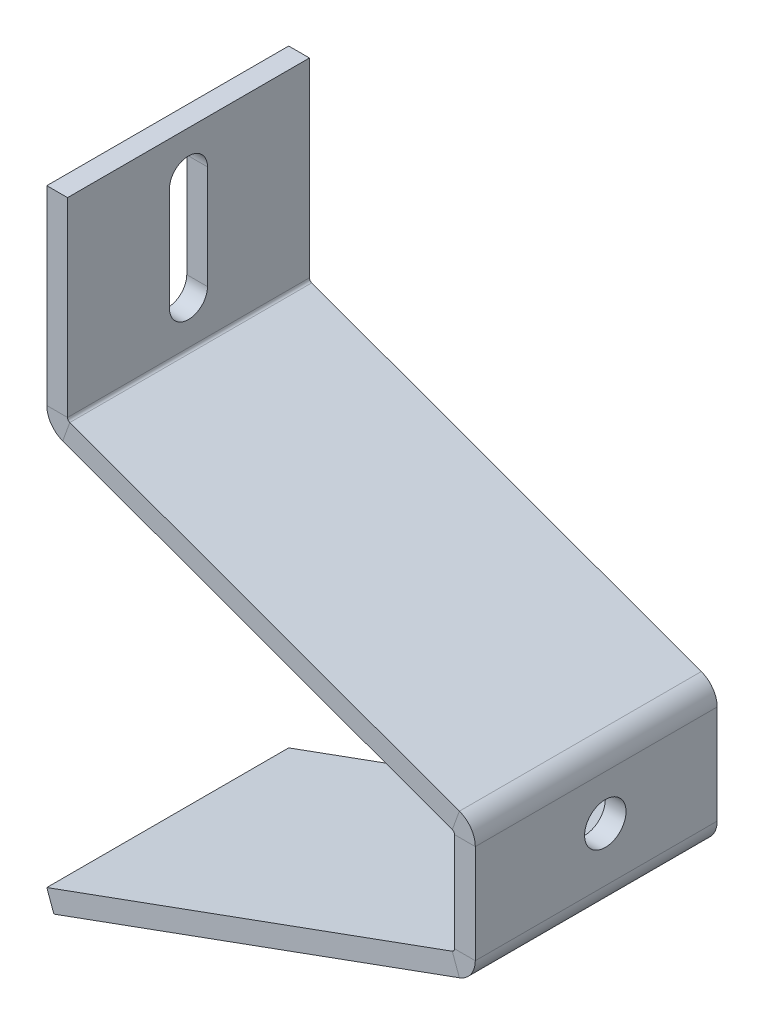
ISO-10303-21;
HEADER;
FILE_DESCRIPTION(('STEP AP214'),'2;1');
FILE_NAME('part.step','',(''),(''),'','','');
FILE_SCHEMA(('AUTOMOTIVE_DESIGN { 1 0 10303 214 1 1 1 1 }'));
ENDSEC;
DATA;
#1=APPLICATION_CONTEXT('core data for automotive mechanical design processes');
#2=APPLICATION_PROTOCOL_DEFINITION('international standard','automotive_design',2000,#1);
#3=PRODUCT_CONTEXT('',#1,'mechanical');
#4=PRODUCT('Part','Part','',(#3));
#5=PRODUCT_RELATED_PRODUCT_CATEGORY('part','',(#4));
#6=PRODUCT_DEFINITION_FORMATION('','',#4);
#7=PRODUCT_DEFINITION_CONTEXT('part definition',#1,'design');
#8=PRODUCT_DEFINITION('design','',#6,#7);
#9=PRODUCT_DEFINITION_SHAPE('','',#8);
#10=(LENGTH_UNIT() NAMED_UNIT(*) SI_UNIT(.MILLI.,.METRE.));
#11=(NAMED_UNIT(*) PLANE_ANGLE_UNIT() SI_UNIT($,.RADIAN.));
#12=(NAMED_UNIT(*) SI_UNIT($,.STERADIAN.) SOLID_ANGLE_UNIT());
#13=UNCERTAINTY_MEASURE_WITH_UNIT(LENGTH_MEASURE(1.E-05),#10,'distance_accuracy_value','');
#14=(GEOMETRIC_REPRESENTATION_CONTEXT(3) GLOBAL_UNCERTAINTY_ASSIGNED_CONTEXT((#13)) GLOBAL_UNIT_ASSIGNED_CONTEXT((#10,
#11,#12)) REPRESENTATION_CONTEXT('',''));
#15=CARTESIAN_POINT('',(0.,0.,0.));
#16=DIRECTION('',(0.,0.,1.));
#17=DIRECTION('',(1.,0.,0.));
#18=AXIS2_PLACEMENT_3D('',#15,#16,#17);
#19=CARTESIAN_POINT('',(118.,43.6486951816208,70.));
#20=DIRECTION('',(0.,0.,1.));
#21=DIRECTION('',(1.,0.,0.));
#22=AXIS2_PLACEMENT_3D('',#19,#20,#21);
#23=PLANE('',#22);
#24=DIRECTION('',(1.,0.,0.));
#25=VECTOR('',#24,1.);
#26=CARTESIAN_POINT('',(118.,43.6486951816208,70.));
#27=LINE('',#26,#25);
#28=CARTESIAN_POINT('',(118.,43.6486951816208,70.));
#29=VERTEX_POINT('',#28);
#30=CARTESIAN_POINT('',(124.,43.6486951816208,70.));
#31=VERTEX_POINT('',#30);
#32=EDGE_CURVE('E467',#29,#31,#27,.T.);
#33=ORIENTED_EDGE('',*,*,#32,.F.);
#34=CARTESIAN_POINT('',(117.,43.6486951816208,70.));
#35=DIRECTION('',(0.,0.,-1.));
#36=DIRECTION('',(-1.,0.,0.));
#37=AXIS2_PLACEMENT_3D('',#34,#35,#36);
#38=CIRCLE('',#37,1.);
#39=CARTESIAN_POINT('',(117.342020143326,42.7090025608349,70.));
#40=VERTEX_POINT('',#39);
#41=EDGE_CURVE('E290',#40,#29,#38,.F.);
#42=ORIENTED_EDGE('',*,*,#41,.F.);
#43=DIRECTION('',(-0.342020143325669,0.939692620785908,0.));
#44=VECTOR('',#43,1.);
#45=CARTESIAN_POINT('',(119.39414100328,37.0708468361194,70.));
#46=LINE('',#45,#44);
#47=CARTESIAN_POINT('',(119.39414100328,37.0708468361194,70.));
#48=VERTEX_POINT('',#47);
#49=EDGE_CURVE('E465',#48,#40,#46,.T.);
#50=ORIENTED_EDGE('',*,*,#49,.F.);
#51=CARTESIAN_POINT('',(117.,43.6486951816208,70.));
#52=DIRECTION('',(0.,0.,1.));
#53=DIRECTION('',(1.,0.,0.));
#54=AXIS2_PLACEMENT_3D('',#51,#52,#53);
#55=CIRCLE('',#54,7.);
#56=EDGE_CURVE('E305',#48,#31,#55,.T.);
#57=ORIENTED_EDGE('',*,*,#56,.T.);
#58=EDGE_LOOP('',(#33,#42,#50,#57));
#59=FACE_BOUND('',#58,.T.);
#60=ADVANCED_FACE('F46',(#59),#23,.T.);
#61=CARTESIAN_POINT('',(119.39414100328,37.0708468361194,70.));
#62=DIRECTION('',(0.,0.,1.));
#63=DIRECTION('',(1.,0.,0.));
#64=AXIS2_PLACEMENT_3D('',#61,#62,#63);
#65=PLANE('',#64);
#66=DIRECTION('',(0.,1.,0.));
#67=VECTOR('',#66,1.);
#68=CARTESIAN_POINT('',(118.,42.9484876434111,70.));
#69=LINE('',#68,#67);
#70=CARTESIAN_POINT('',(118.,72.2482801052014,70.));
#71=VERTEX_POINT('',#70);
#72=EDGE_CURVE('E286',#29,#71,#69,.T.);
#73=ORIENTED_EDGE('',*,*,#72,.F.);
#74=ORIENTED_EDGE('',*,*,#32,.T.);
#75=DIRECTION('',(0.,1.,0.));
#76=VECTOR('',#75,1.);
#77=CARTESIAN_POINT('',(124.,42.9484876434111,70.));
#78=LINE('',#77,#76);
#79=CARTESIAN_POINT('',(124.,72.2482801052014,70.));
#80=VERTEX_POINT('',#79);
#81=EDGE_CURVE('E309',#31,#80,#78,.T.);
#82=ORIENTED_EDGE('',*,*,#81,.T.);
#83=DIRECTION('',(-1.,0.,0.));
#84=VECTOR('',#83,1.);
#85=CARTESIAN_POINT('',(124.,72.2482801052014,70.));
#86=LINE('',#85,#84);
#87=EDGE_CURVE('E457',#80,#71,#86,.T.);
#88=ORIENTED_EDGE('',*,*,#87,.T.);
#89=EDGE_LOOP('',(#73,#74,#82,#88));
#90=FACE_BOUND('',#89,.T.);
#91=ADVANCED_FACE('F496',(#90),#65,.T.);
#92=CARTESIAN_POINT('',(117.342020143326,42.7090025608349,0.));
#93=DIRECTION('',(0.,0.,-1.));
#94=DIRECTION('',(-1.,0.,0.));
#95=AXIS2_PLACEMENT_3D('',#92,#93,#94);
#96=PLANE('',#95);
#97=DIRECTION('',(0.342020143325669,-0.939692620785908,0.));
#98=VECTOR('',#97,1.);
#99=CARTESIAN_POINT('',(117.342020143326,42.7090025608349,0.));
#100=LINE('',#99,#98);
#101=CARTESIAN_POINT('',(117.342020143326,42.7090025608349,0.));
#102=VERTEX_POINT('',#101);
#103=CARTESIAN_POINT('',(119.39414100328,37.0708468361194,0.));
#104=VERTEX_POINT('',#103);
#105=EDGE_CURVE('E463',#102,#104,#100,.T.);
#106=ORIENTED_EDGE('',*,*,#105,.F.);
#107=CARTESIAN_POINT('',(117.,43.6486951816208,0.));
#108=DIRECTION('',(0.,0.,-1.));
#109=DIRECTION('',(-1.,0.,0.));
#110=AXIS2_PLACEMENT_3D('',#107,#108,#109);
#111=CIRCLE('',#110,1.);
#112=CARTESIAN_POINT('',(118.,43.6486951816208,0.));
#113=VERTEX_POINT('',#112);
#114=EDGE_CURVE('E352',#102,#113,#111,.F.);
#115=ORIENTED_EDGE('',*,*,#114,.T.);
#116=DIRECTION('',(-1.,0.,0.));
#117=VECTOR('',#116,1.);
#118=CARTESIAN_POINT('',(124.,43.6486951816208,0.));
#119=LINE('',#118,#117);
#120=CARTESIAN_POINT('',(124.,43.6486951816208,0.));
#121=VERTEX_POINT('',#120);
#122=EDGE_CURVE('E461',#121,#113,#119,.T.);
#123=ORIENTED_EDGE('',*,*,#122,.F.);
#124=CARTESIAN_POINT('',(117.,43.6486951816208,0.));
#125=DIRECTION('',(0.,0.,1.));
#126=DIRECTION('',(1.,0.,0.));
#127=AXIS2_PLACEMENT_3D('',#124,#125,#126);
#128=CIRCLE('',#127,7.);
#129=EDGE_CURVE('E367',#104,#121,#128,.T.);
#130=ORIENTED_EDGE('',*,*,#129,.F.);
#131=EDGE_LOOP('',(#106,#115,#123,#130));
#132=FACE_BOUND('',#131,.T.);
#133=ADVANCED_FACE('F502',(#132),#96,.T.);
#134=CARTESIAN_POINT('',(124.,43.6486951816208,0.));
#135=DIRECTION('',(0.,0.,-1.));
#136=DIRECTION('',(-1.,0.,0.));
#137=AXIS2_PLACEMENT_3D('',#134,#135,#136);
#138=PLANE('',#137);
#139=DIRECTION('',(0.93969262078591,0.342020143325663,0.));
#140=VECTOR('',#139,1.);
#141=CARTESIAN_POINT('',(0.,0.,0.));
#142=LINE('',#141,#140);
#143=CARTESIAN_POINT('',(0.,0.,0.));
#144=VERTEX_POINT('',#143);
#145=EDGE_CURVE('E356',#144,#102,#142,.T.);
#146=ORIENTED_EDGE('',*,*,#145,.T.);
#147=ORIENTED_EDGE('',*,*,#105,.T.);
#148=DIRECTION('',(0.939692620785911,0.342020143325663,0.));
#149=VECTOR('',#148,1.);
#150=CARTESIAN_POINT('',(2.05212085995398,-5.63815572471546,0.));
#151=LINE('',#150,#149);
#152=CARTESIAN_POINT('',(2.05212085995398,-5.63815572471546,0.));
#153=VERTEX_POINT('',#152);
#154=EDGE_CURVE('E363',#153,#104,#151,.T.);
#155=ORIENTED_EDGE('',*,*,#154,.F.);
#156=DIRECTION('',(-0.342020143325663,0.93969262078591,0.));
#157=VECTOR('',#156,1.);
#158=CARTESIAN_POINT('',(2.05212085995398,-5.63815572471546,0.));
#159=LINE('',#158,#157);
#160=EDGE_CURVE('E360',#153,#144,#159,.T.);
#161=ORIENTED_EDGE('',*,*,#160,.T.);
#162=EDGE_LOOP('',(#146,#147,#155,#161));
#163=FACE_BOUND('',#162,.T.);
#164=ADVANCED_FACE('F559',(#163),#138,.T.);
#165=CARTESIAN_POINT('',(117.342020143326,73.1879727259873,70.));
#166=DIRECTION('',(0.,0.,1.));
#167=DIRECTION('',(1.,0.,0.));
#168=AXIS2_PLACEMENT_3D('',#165,#166,#167);
#169=PLANE('',#168);
#170=DIRECTION('',(0.342020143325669,0.939692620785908,0.));
#171=VECTOR('',#170,1.);
#172=CARTESIAN_POINT('',(117.342020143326,73.1879727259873,70.));
#173=LINE('',#172,#171);
#174=CARTESIAN_POINT('',(117.342020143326,73.1879727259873,70.));
#175=VERTEX_POINT('',#174);
#176=CARTESIAN_POINT('',(119.39414100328,78.8261284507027,70.));
#177=VERTEX_POINT('',#176);
#178=EDGE_CURVE('E459',#175,#177,#173,.T.);
#179=ORIENTED_EDGE('',*,*,#178,.F.);
#180=CARTESIAN_POINT('',(117.,72.2482801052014,70.));
#181=DIRECTION('',(0.,0.,-1.));
#182=DIRECTION('',(-1.,0.,0.));
#183=AXIS2_PLACEMENT_3D('',#180,#181,#182);
#184=CIRCLE('',#183,1.);
#185=EDGE_CURVE('E282',#71,#175,#184,.F.);
#186=ORIENTED_EDGE('',*,*,#185,.F.);
#187=ORIENTED_EDGE('',*,*,#87,.F.);
#188=CARTESIAN_POINT('',(117.,72.2482801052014,70.));
#189=DIRECTION('',(0.,0.,1.));
#190=DIRECTION('',(1.,0.,0.));
#191=AXIS2_PLACEMENT_3D('',#188,#189,#190);
#192=CIRCLE('',#191,7.);
#193=EDGE_CURVE('E313',#80,#177,#192,.T.);
#194=ORIENTED_EDGE('',*,*,#193,.T.);
#195=EDGE_LOOP('',(#179,#186,#187,#194));
#196=FACE_BOUND('',#195,.T.);
#197=ADVANCED_FACE('F547',(#196),#169,.T.);
#198=CARTESIAN_POINT('',(124.,72.2482801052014,70.));
#199=DIRECTION('',(0.,0.,1.));
#200=DIRECTION('',(1.,0.,0.));
#201=AXIS2_PLACEMENT_3D('',#198,#199,#200);
#202=PLANE('',#201);
#203=DIRECTION('',(-0.939692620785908,0.342020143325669,0.));
#204=VECTOR('',#203,1.);
#205=CARTESIAN_POINT('',(118.,72.9484876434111,70.));
#206=LINE('',#205,#204);
#207=CARTESIAN_POINT('',(4.60585899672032,114.22057970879,70.));
#208=VERTEX_POINT('',#207);
#209=EDGE_CURVE('E278',#175,#208,#206,.T.);
#210=ORIENTED_EDGE('',*,*,#209,.F.);
#211=ORIENTED_EDGE('',*,*,#178,.T.);
#212=DIRECTION('',(-0.939692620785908,0.342020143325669,0.));
#213=VECTOR('',#212,1.);
#214=CARTESIAN_POINT('',(120.052120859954,78.5866433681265,70.));
#215=LINE('',#214,#213);
#216=CARTESIAN_POINT('',(6.65797985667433,119.858735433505,70.));
#217=VERTEX_POINT('',#216);
#218=EDGE_CURVE('E317',#177,#217,#215,.T.);
#219=ORIENTED_EDGE('',*,*,#218,.T.);
#220=DIRECTION('',(-0.34202014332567,-0.939692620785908,0.));
#221=VECTOR('',#220,1.);
#222=CARTESIAN_POINT('',(6.65797985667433,119.858735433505,70.));
#223=LINE('',#222,#221);
#224=EDGE_CURVE('E449',#217,#208,#223,.T.);
#225=ORIENTED_EDGE('',*,*,#224,.T.);
#226=EDGE_LOOP('',(#210,#211,#219,#225));
#227=FACE_BOUND('',#226,.T.);
#228=ADVANCED_FACE('F565',(#227),#202,.T.);
#229=CARTESIAN_POINT('',(118.,72.2482801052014,0.));
#230=DIRECTION('',(0.,0.,-1.));
#231=DIRECTION('',(-1.,0.,0.));
#232=AXIS2_PLACEMENT_3D('',#229,#230,#231);
#233=PLANE('',#232);
#234=DIRECTION('',(1.,0.,0.));
#235=VECTOR('',#234,1.);
#236=CARTESIAN_POINT('',(118.,72.2482801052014,0.));
#237=LINE('',#236,#235);
#238=CARTESIAN_POINT('',(118.,72.2482801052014,0.));
#239=VERTEX_POINT('',#238);
#240=CARTESIAN_POINT('',(124.,72.2482801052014,0.));
#241=VERTEX_POINT('',#240);
#242=EDGE_CURVE('E455',#239,#241,#237,.T.);
#243=ORIENTED_EDGE('',*,*,#242,.F.);
#244=CARTESIAN_POINT('',(117.,72.2482801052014,0.));
#245=DIRECTION('',(0.,0.,-1.));
#246=DIRECTION('',(-1.,0.,0.));
#247=AXIS2_PLACEMENT_3D('',#244,#245,#246);
#248=CIRCLE('',#247,1.);
#249=CARTESIAN_POINT('',(117.342020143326,73.1879727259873,0.));
#250=VERTEX_POINT('',#249);
#251=EDGE_CURVE('E344',#239,#250,#248,.F.);
#252=ORIENTED_EDGE('',*,*,#251,.T.);
#253=DIRECTION('',(-0.342020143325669,-0.939692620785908,0.));
#254=VECTOR('',#253,1.);
#255=CARTESIAN_POINT('',(119.39414100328,78.8261284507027,0.));
#256=LINE('',#255,#254);
#257=CARTESIAN_POINT('',(119.39414100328,78.8261284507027,0.));
#258=VERTEX_POINT('',#257);
#259=EDGE_CURVE('E453',#258,#250,#256,.T.);
#260=ORIENTED_EDGE('',*,*,#259,.F.);
#261=CARTESIAN_POINT('',(117.,72.2482801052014,0.));
#262=DIRECTION('',(0.,0.,1.));
#263=DIRECTION('',(1.,0.,0.));
#264=AXIS2_PLACEMENT_3D('',#261,#262,#263);
#265=CIRCLE('',#264,7.);
#266=EDGE_CURVE('E375',#241,#258,#265,.T.);
#267=ORIENTED_EDGE('',*,*,#266,.F.);
#268=EDGE_LOOP('',(#243,#252,#260,#267));
#269=FACE_BOUND('',#268,.T.);
#270=ADVANCED_FACE('F571',(#269),#233,.T.);
#271=CARTESIAN_POINT('',(119.39414100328,78.8261284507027,0.));
#272=DIRECTION('',(0.,0.,-1.));
#273=DIRECTION('',(-1.,0.,0.));
#274=AXIS2_PLACEMENT_3D('',#271,#272,#273);
#275=PLANE('',#274);
#276=DIRECTION('',(0.,1.,0.));
#277=VECTOR('',#276,1.);
#278=CARTESIAN_POINT('',(118.,42.9484876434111,0.));
#279=LINE('',#278,#277);
#280=EDGE_CURVE('E348',#113,#239,#279,.T.);
#281=ORIENTED_EDGE('',*,*,#280,.T.);
#282=ORIENTED_EDGE('',*,*,#242,.T.);
#283=DIRECTION('',(0.,1.,0.));
#284=VECTOR('',#283,1.);
#285=CARTESIAN_POINT('',(124.,42.9484876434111,0.));
#286=LINE('',#285,#284);
#287=EDGE_CURVE('E371',#121,#241,#286,.T.);
#288=ORIENTED_EDGE('',*,*,#287,.F.);
#289=ORIENTED_EDGE('',*,*,#122,.T.);
#290=EDGE_LOOP('',(#281,#282,#288,#289));
#291=FACE_BOUND('',#290,.T.);
#292=ADVANCED_FACE('F556',(#291),#275,.T.);
#293=CARTESIAN_POINT('',(0.,120.798428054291,70.));
#294=DIRECTION('',(0.,0.,1.));
#295=DIRECTION('',(1.,0.,0.));
#296=AXIS2_PLACEMENT_3D('',#293,#294,#295);
#297=PLANE('',#296);
#298=DIRECTION('',(1.,0.,0.));
#299=VECTOR('',#298,1.);
#300=CARTESIAN_POINT('',(0.,120.798428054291,70.));
#301=LINE('',#300,#299);
#302=CARTESIAN_POINT('',(0.,120.798428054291,70.));
#303=VERTEX_POINT('',#302);
#304=CARTESIAN_POINT('',(6.,120.798428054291,70.));
#305=VERTEX_POINT('',#304);
#306=EDGE_CURVE('E451',#303,#305,#301,.T.);
#307=ORIENTED_EDGE('',*,*,#306,.F.);
#308=CARTESIAN_POINT('',(7.,120.798428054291,70.));
#309=DIRECTION('',(0.,0.,1.));
#310=DIRECTION('',(1.,0.,0.));
#311=AXIS2_PLACEMENT_3D('',#308,#309,#310);
#312=CIRCLE('',#311,7.);
#313=EDGE_CURVE('E274',#208,#303,#312,.F.);
#314=ORIENTED_EDGE('',*,*,#313,.F.);
#315=ORIENTED_EDGE('',*,*,#224,.F.);
#316=CARTESIAN_POINT('',(7.,120.798428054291,70.));
#317=DIRECTION('',(0.,0.,1.));
#318=DIRECTION('',(1.,0.,0.));
#319=AXIS2_PLACEMENT_3D('',#316,#317,#318);
#320=CIRCLE('',#319,1.);
#321=EDGE_CURVE('E321',#217,#305,#320,.F.);
#322=ORIENTED_EDGE('',*,*,#321,.T.);
#323=EDGE_LOOP('',(#307,#314,#315,#322));
#324=FACE_BOUND('',#323,.T.);
#325=ADVANCED_FACE('F576',(#324),#297,.T.);
#326=CARTESIAN_POINT('',(6.65797985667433,119.858735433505,70.));
#327=DIRECTION('',(0.,0.,1.));
#328=DIRECTION('',(1.,0.,0.));
#329=AXIS2_PLACEMENT_3D('',#326,#327,#328);
#330=PLANE('',#329);
#331=DIRECTION('',(0.,1.,0.));
#332=VECTOR('',#331,1.);
#333=CARTESIAN_POINT('',(0.,115.896975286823,70.));
#334=LINE('',#333,#332);
#335=CARTESIAN_POINT('',(0.,175.896975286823,70.));
#336=VERTEX_POINT('',#335);
#337=EDGE_CURVE('E271',#303,#336,#334,.T.);
#338=ORIENTED_EDGE('',*,*,#337,.F.);
#339=ORIENTED_EDGE('',*,*,#306,.T.);
#340=DIRECTION('',(0.,1.,0.));
#341=VECTOR('',#340,1.);
#342=CARTESIAN_POINT('',(6.,115.896975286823,70.));
#343=LINE('',#342,#341);
#344=CARTESIAN_POINT('',(6.,175.896975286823,70.));
#345=VERTEX_POINT('',#344);
#346=EDGE_CURVE('E264',#305,#345,#343,.T.);
#347=ORIENTED_EDGE('',*,*,#346,.T.);
#348=DIRECTION('',(1.,0.,0.));
#349=VECTOR('',#348,1.);
#350=CARTESIAN_POINT('',(0.,175.896975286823,70.));
#351=LINE('',#350,#349);
#352=EDGE_CURVE('E267',#336,#345,#351,.T.);
#353=ORIENTED_EDGE('',*,*,#352,.F.);
#354=EDGE_LOOP('',(#338,#339,#347,#353));
#355=FACE_BOUND('',#354,.T.);
#356=ADVANCED_FACE('F579',(#355),#330,.T.);
#357=CARTESIAN_POINT('',(4.60585899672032,114.22057970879,0.));
#358=DIRECTION('',(0.,0.,-1.));
#359=DIRECTION('',(-1.,0.,0.));
#360=AXIS2_PLACEMENT_3D('',#357,#358,#359);
#361=PLANE('',#360);
#362=DIRECTION('',(0.34202014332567,0.939692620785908,0.));
#363=VECTOR('',#362,1.);
#364=CARTESIAN_POINT('',(4.60585899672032,114.22057970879,0.));
#365=LINE('',#364,#363);
#366=CARTESIAN_POINT('',(4.60585899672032,114.22057970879,0.));
#367=VERTEX_POINT('',#366);
#368=CARTESIAN_POINT('',(6.65797985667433,119.858735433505,0.));
#369=VERTEX_POINT('',#368);
#370=EDGE_CURVE('E447',#367,#369,#365,.T.);
#371=ORIENTED_EDGE('',*,*,#370,.F.);
#372=CARTESIAN_POINT('',(7.,120.798428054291,0.));
#373=DIRECTION('',(0.,0.,1.));
#374=DIRECTION('',(1.,0.,0.));
#375=AXIS2_PLACEMENT_3D('',#372,#373,#374);
#376=CIRCLE('',#375,7.);
#377=CARTESIAN_POINT('',(0.,120.798428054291,0.));
#378=VERTEX_POINT('',#377);
#379=EDGE_CURVE('E336',#367,#378,#376,.F.);
#380=ORIENTED_EDGE('',*,*,#379,.T.);
#381=DIRECTION('',(-1.,0.,0.));
#382=VECTOR('',#381,1.);
#383=CARTESIAN_POINT('',(6.,120.798428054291,0.));
#384=LINE('',#383,#382);
#385=CARTESIAN_POINT('',(6.,120.798428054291,0.));
#386=VERTEX_POINT('',#385);
#387=EDGE_CURVE('E445',#386,#378,#384,.T.);
#388=ORIENTED_EDGE('',*,*,#387,.F.);
#389=CARTESIAN_POINT('',(7.,120.798428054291,0.));
#390=DIRECTION('',(0.,0.,1.));
#391=DIRECTION('',(1.,0.,0.));
#392=AXIS2_PLACEMENT_3D('',#389,#390,#391);
#393=CIRCLE('',#392,1.);
#394=EDGE_CURVE('E268',#369,#386,#393,.F.);
#395=ORIENTED_EDGE('',*,*,#394,.F.);
#396=EDGE_LOOP('',(#371,#380,#388,#395));
#397=FACE_BOUND('',#396,.T.);
#398=ADVANCED_FACE('F583',(#397),#361,.T.);
#399=CARTESIAN_POINT('',(6.,120.798428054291,0.));
#400=DIRECTION('',(0.,0.,-1.));
#401=DIRECTION('',(-1.,0.,0.));
#402=AXIS2_PLACEMENT_3D('',#399,#400,#401);
#403=PLANE('',#402);
#404=DIRECTION('',(-0.939692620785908,0.342020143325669,0.));
#405=VECTOR('',#404,1.);
#406=CARTESIAN_POINT('',(118.,72.9484876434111,0.));
#407=LINE('',#406,#405);
#408=EDGE_CURVE('E340',#250,#367,#407,.T.);
#409=ORIENTED_EDGE('',*,*,#408,.T.);
#410=ORIENTED_EDGE('',*,*,#370,.T.);
#411=DIRECTION('',(-0.939692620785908,0.342020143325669,0.));
#412=VECTOR('',#411,1.);
#413=CARTESIAN_POINT('',(120.052120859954,78.5866433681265,0.));
#414=LINE('',#413,#412);
#415=EDGE_CURVE('E379',#258,#369,#414,.T.);
#416=ORIENTED_EDGE('',*,*,#415,.F.);
#417=ORIENTED_EDGE('',*,*,#259,.T.);
#418=EDGE_LOOP('',(#409,#410,#416,#417));
#419=FACE_BOUND('',#418,.T.);
#420=ADVANCED_FACE('F587',(#419),#403,.T.);
#421=CARTESIAN_POINT('',(6.,115.896975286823,70.));
#422=DIRECTION('',(-1.,0.,0.));
#423=DIRECTION('',(0.,-1.,0.));
#424=AXIS2_PLACEMENT_3D('',#421,#422,#423);
#425=PLANE('',#424);
#426=DIRECTION('',(0.,1.,0.));
#427=VECTOR('',#426,1.);
#428=CARTESIAN_POINT('',(6.,133.347701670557,29.5));
#429=LINE('',#428,#427);
#430=CARTESIAN_POINT('',(6.,133.347701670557,29.5));
#431=VERTEX_POINT('',#430);
#432=CARTESIAN_POINT('',(6.,163.347701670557,29.5));
#433=VERTEX_POINT('',#432);
#434=EDGE_CURVE('E234',#431,#433,#429,.T.);
#435=ORIENTED_EDGE('',*,*,#434,.F.);
#436=CARTESIAN_POINT('',(6.,133.347701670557,35.));
#437=DIRECTION('',(1.,0.,0.));
#438=DIRECTION('',(0.,1.,0.));
#439=AXIS2_PLACEMENT_3D('',#436,#437,#438);
#440=CIRCLE('',#439,5.5);
#441=CARTESIAN_POINT('',(6.,133.347701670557,40.5));
#442=VERTEX_POINT('',#441);
#443=EDGE_CURVE('E63',#442,#431,#440,.T.);
#444=ORIENTED_EDGE('',*,*,#443,.F.);
#445=DIRECTION('',(0.,-1.,0.));
#446=VECTOR('',#445,1.);
#447=CARTESIAN_POINT('',(6.,133.347701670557,40.5));
#448=LINE('',#447,#446);
#449=CARTESIAN_POINT('',(6.,163.347701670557,40.5));
#450=VERTEX_POINT('',#449);
#451=EDGE_CURVE('E242',#450,#442,#448,.T.);
#452=ORIENTED_EDGE('',*,*,#451,.F.);
#453=CARTESIAN_POINT('',(6.,163.347701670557,35.));
#454=DIRECTION('',(1.,0.,0.));
#455=DIRECTION('',(0.,1.,0.));
#456=AXIS2_PLACEMENT_3D('',#453,#454,#455);
#457=CIRCLE('',#456,5.50000000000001);
#458=EDGE_CURVE('E225',#433,#450,#457,.T.);
#459=ORIENTED_EDGE('',*,*,#458,.F.);
#460=EDGE_LOOP('',(#435,#444,#452,#459));
#461=FACE_BOUND('',#460,.T.);
#462=DIRECTION('',(0.,1.,0.));
#463=VECTOR('',#462,1.);
#464=CARTESIAN_POINT('',(6.,115.896975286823,0.));
#465=LINE('',#464,#463);
#466=CARTESIAN_POINT('',(6.,175.896975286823,0.));
#467=VERTEX_POINT('',#466);
#468=EDGE_CURVE('E263',#386,#467,#465,.T.);
#469=ORIENTED_EDGE('',*,*,#468,.T.);
#470=DIRECTION('',(0.,0.,-1.));
#471=VECTOR('',#470,1.);
#472=CARTESIAN_POINT('',(6.,175.896975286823,70.));
#473=LINE('',#472,#471);
#474=EDGE_CURVE('E442',#345,#467,#473,.T.);
#475=ORIENTED_EDGE('',*,*,#474,.F.);
#476=ORIENTED_EDGE('',*,*,#346,.F.);
#477=DIRECTION('',(0.,0.,-1.));
#478=VECTOR('',#477,1.);
#479=CARTESIAN_POINT('',(6.,120.798428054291,70.));
#480=LINE('',#479,#478);
#481=EDGE_CURVE('E325',#305,#386,#480,.T.);
#482=ORIENTED_EDGE('',*,*,#481,.T.);
#483=EDGE_LOOP('',(#469,#475,#476,#482));
#484=FACE_BOUND('',#483,.T.);
#485=ADVANCED_FACE('F239',(#461,#484),#425,.F.);
#486=CARTESIAN_POINT('',(0.,175.896975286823,70.));
#487=DIRECTION('',(0.,1.,0.));
#488=DIRECTION('',(0.,0.,1.));
#489=AXIS2_PLACEMENT_3D('',#486,#487,#488);
#490=PLANE('',#489);
#491=DIRECTION('',(1.,0.,0.));
#492=VECTOR('',#491,1.);
#493=CARTESIAN_POINT('',(0.,175.896975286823,0.));
#494=LINE('',#493,#492);
#495=CARTESIAN_POINT('',(0.,175.896975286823,0.));
#496=VERTEX_POINT('',#495);
#497=EDGE_CURVE('E329',#496,#467,#494,.T.);
#498=ORIENTED_EDGE('',*,*,#497,.F.);
#499=DIRECTION('',(0.,0.,-1.));
#500=VECTOR('',#499,1.);
#501=CARTESIAN_POINT('',(0.,175.896975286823,70.));
#502=LINE('',#501,#500);
#503=EDGE_CURVE('E439',#336,#496,#502,.T.);
#504=ORIENTED_EDGE('',*,*,#503,.F.);
#505=ORIENTED_EDGE('',*,*,#352,.T.);
#506=ORIENTED_EDGE('',*,*,#474,.T.);
#507=EDGE_LOOP('',(#498,#504,#505,#506));
#508=FACE_BOUND('',#507,.T.);
#509=ADVANCED_FACE('F594',(#508),#490,.T.);
#510=CARTESIAN_POINT('',(0.,115.896975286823,70.));
#511=DIRECTION('',(-1.,0.,0.));
#512=DIRECTION('',(0.,-1.,0.));
#513=AXIS2_PLACEMENT_3D('',#510,#511,#512);
#514=PLANE('',#513);
#515=CARTESIAN_POINT('',(0.,133.347701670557,35.));
#516=DIRECTION('',(-1.,0.,0.));
#517=DIRECTION('',(0.,-1.,0.));
#518=AXIS2_PLACEMENT_3D('',#515,#516,#517);
#519=CIRCLE('',#518,5.5);
#520=CARTESIAN_POINT('',(0.,133.347701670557,29.5));
#521=VERTEX_POINT('',#520);
#522=CARTESIAN_POINT('',(0.,133.347701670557,40.5));
#523=VERTEX_POINT('',#522);
#524=EDGE_CURVE('E11',#521,#523,#519,.T.);
#525=ORIENTED_EDGE('',*,*,#524,.F.);
#526=DIRECTION('',(0.,-1.,0.));
#527=VECTOR('',#526,1.);
#528=CARTESIAN_POINT('',(0.,115.896975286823,29.5));
#529=LINE('',#528,#527);
#530=CARTESIAN_POINT('',(0.,163.347701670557,29.5));
#531=VERTEX_POINT('',#530);
#532=EDGE_CURVE('E469',#531,#521,#529,.T.);
#533=ORIENTED_EDGE('',*,*,#532,.F.);
#534=CARTESIAN_POINT('',(0.,163.347701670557,35.));
#535=DIRECTION('',(-1.,0.,0.));
#536=DIRECTION('',(0.,-1.,0.));
#537=AXIS2_PLACEMENT_3D('',#534,#535,#536);
#538=CIRCLE('',#537,5.50000000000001);
#539=CARTESIAN_POINT('',(0.,163.347701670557,40.5));
#540=VERTEX_POINT('',#539);
#541=EDGE_CURVE('E228',#540,#531,#538,.T.);
#542=ORIENTED_EDGE('',*,*,#541,.F.);
#543=DIRECTION('',(0.,1.,0.));
#544=VECTOR('',#543,1.);
#545=CARTESIAN_POINT('',(0.,115.896975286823,40.5));
#546=LINE('',#545,#544);
#547=EDGE_CURVE('E54',#523,#540,#546,.T.);
#548=ORIENTED_EDGE('',*,*,#547,.F.);
#549=EDGE_LOOP('',(#525,#533,#542,#548));
#550=FACE_BOUND('',#549,.T.);
#551=DIRECTION('',(0.,1.,0.));
#552=VECTOR('',#551,1.);
#553=CARTESIAN_POINT('',(0.,115.896975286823,0.));
#554=LINE('',#553,#552);
#555=EDGE_CURVE('E332',#378,#496,#554,.T.);
#556=ORIENTED_EDGE('',*,*,#555,.F.);
#557=DIRECTION('',(0.,0.,-1.));
#558=VECTOR('',#557,1.);
#559=CARTESIAN_POINT('',(0.,120.798428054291,70.));
#560=LINE('',#559,#558);
#561=EDGE_CURVE('E435',#303,#378,#560,.T.);
#562=ORIENTED_EDGE('',*,*,#561,.F.);
#563=ORIENTED_EDGE('',*,*,#337,.T.);
#564=ORIENTED_EDGE('',*,*,#503,.T.);
#565=EDGE_LOOP('',(#556,#562,#563,#564));
#566=FACE_BOUND('',#565,.T.);
#567=ADVANCED_FACE('F479',(#550,#566),#514,.T.);
#568=CARTESIAN_POINT('',(7.,120.798428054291,70.));
#569=DIRECTION('',(0.,0.,-1.));
#570=DIRECTION('',(-1.,0.,0.));
#571=AXIS2_PLACEMENT_3D('',#568,#569,#570);
#572=CYLINDRICAL_SURFACE('',#571,7.);
#573=ORIENTED_EDGE('',*,*,#379,.F.);
#574=DIRECTION('',(0.,0.,-1.));
#575=VECTOR('',#574,1.);
#576=CARTESIAN_POINT('',(4.60585899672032,114.22057970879,70.));
#577=LINE('',#576,#575);
#578=EDGE_CURVE('E431',#208,#367,#577,.T.);
#579=ORIENTED_EDGE('',*,*,#578,.F.);
#580=ORIENTED_EDGE('',*,*,#313,.T.);
#581=ORIENTED_EDGE('',*,*,#561,.T.);
#582=EDGE_LOOP('',(#573,#579,#580,#581));
#583=FACE_BOUND('',#582,.T.);
#584=ADVANCED_FACE('F600',(#583),#572,.T.);
#585=CARTESIAN_POINT('',(118.,72.9484876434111,70.));
#586=DIRECTION('',(-0.342020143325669,-0.939692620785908,0.));
#587=DIRECTION('',(0.939692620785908,-0.342020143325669,0.));
#588=AXIS2_PLACEMENT_3D('',#585,#586,#587);
#589=PLANE('',#588);
#590=ORIENTED_EDGE('',*,*,#408,.F.);
#591=DIRECTION('',(0.,0.,-1.));
#592=VECTOR('',#591,1.);
#593=CARTESIAN_POINT('',(117.342020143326,73.1879727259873,70.));
#594=LINE('',#593,#592);
#595=EDGE_CURVE('E427',#175,#250,#594,.T.);
#596=ORIENTED_EDGE('',*,*,#595,.F.);
#597=ORIENTED_EDGE('',*,*,#209,.T.);
#598=ORIENTED_EDGE('',*,*,#578,.T.);
#599=EDGE_LOOP('',(#590,#596,#597,#598));
#600=FACE_BOUND('',#599,.T.);
#601=ADVANCED_FACE('F603',(#600),#589,.T.);
#602=CARTESIAN_POINT('',(117.,72.2482801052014,70.));
#603=DIRECTION('',(0.,0.,-1.));
#604=DIRECTION('',(-1.,0.,0.));
#605=AXIS2_PLACEMENT_3D('',#602,#603,#604);
#606=CYLINDRICAL_SURFACE('',#605,1.);
#607=ORIENTED_EDGE('',*,*,#251,.F.);
#608=DIRECTION('',(0.,0.,-1.));
#609=VECTOR('',#608,1.);
#610=CARTESIAN_POINT('',(118.,72.2482801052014,70.));
#611=LINE('',#610,#609);
#612=EDGE_CURVE('E423',#71,#239,#611,.T.);
#613=ORIENTED_EDGE('',*,*,#612,.F.);
#614=ORIENTED_EDGE('',*,*,#185,.T.);
#615=ORIENTED_EDGE('',*,*,#595,.T.);
#616=EDGE_LOOP('',(#607,#613,#614,#615));
#617=FACE_BOUND('',#616,.T.);
#618=ADVANCED_FACE('F552',(#617),#606,.F.);
#619=CARTESIAN_POINT('',(118.,42.9484876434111,70.));
#620=DIRECTION('',(-1.,0.,0.));
#621=DIRECTION('',(0.,0.,1.));
#622=AXIS2_PLACEMENT_3D('',#619,#620,#621);
#623=PLANE('',#622);
#624=CARTESIAN_POINT('',(118.,59.2386760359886,32.3801393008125));
#625=DIRECTION('',(-1.,0.,0.));
#626=DIRECTION('',(0.,0.,1.));
#627=AXIS2_PLACEMENT_3D('',#624,#625,#626);
#628=CIRCLE('',#627,6.);
#629=CARTESIAN_POINT('',(118.,59.2386760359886,38.3801393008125));
#630=VERTEX_POINT('',#629);
#631=EDGE_CURVE('E259',#630,#630,#628,.T.);
#632=ORIENTED_EDGE('',*,*,#631,.F.);
#633=EDGE_LOOP('',(#632));
#634=FACE_BOUND('',#633,.T.);
#635=ORIENTED_EDGE('',*,*,#280,.F.);
#636=DIRECTION('',(0.,0.,-1.));
#637=VECTOR('',#636,1.);
#638=CARTESIAN_POINT('',(118.,43.6486951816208,70.));
#639=LINE('',#638,#637);
#640=EDGE_CURVE('E419',#29,#113,#639,.T.);
#641=ORIENTED_EDGE('',*,*,#640,.F.);
#642=ORIENTED_EDGE('',*,*,#72,.T.);
#643=ORIENTED_EDGE('',*,*,#612,.T.);
#644=EDGE_LOOP('',(#635,#641,#642,#643));
#645=FACE_BOUND('',#644,.T.);
#646=ADVANCED_FACE('F511',(#634,#645),#623,.T.);
#647=CARTESIAN_POINT('',(117.,43.6486951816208,70.));
#648=DIRECTION('',(0.,0.,-1.));
#649=DIRECTION('',(-1.,0.,0.));
#650=AXIS2_PLACEMENT_3D('',#647,#648,#649);
#651=CYLINDRICAL_SURFACE('',#650,1.);
#652=ORIENTED_EDGE('',*,*,#114,.F.);
#653=DIRECTION('',(0.,0.,-1.));
#654=VECTOR('',#653,1.);
#655=CARTESIAN_POINT('',(117.342020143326,42.7090025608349,70.));
#656=LINE('',#655,#654);
#657=EDGE_CURVE('E415',#40,#102,#656,.T.);
#658=ORIENTED_EDGE('',*,*,#657,.F.);
#659=ORIENTED_EDGE('',*,*,#41,.T.);
#660=ORIENTED_EDGE('',*,*,#640,.T.);
#661=EDGE_LOOP('',(#652,#658,#659,#660));
#662=FACE_BOUND('',#661,.T.);
#663=ADVANCED_FACE('F516',(#662),#651,.F.);
#664=CARTESIAN_POINT('',(0.,0.,70.));
#665=DIRECTION('',(-0.342020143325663,0.93969262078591,0.));
#666=DIRECTION('',(-0.93969262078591,-0.342020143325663,0.));
#667=AXIS2_PLACEMENT_3D('',#664,#665,#666);
#668=PLANE('',#667);
#669=ORIENTED_EDGE('',*,*,#145,.F.);
#670=DIRECTION('',(0.,0.,-1.));
#671=VECTOR('',#670,1.);
#672=CARTESIAN_POINT('',(0.,0.,70.));
#673=LINE('',#672,#671);
#674=CARTESIAN_POINT('',(0.,0.,70.));
#675=VERTEX_POINT('',#674);
#676=EDGE_CURVE('E412',#675,#144,#673,.T.);
#677=ORIENTED_EDGE('',*,*,#676,.F.);
#678=DIRECTION('',(0.93969262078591,0.342020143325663,0.));
#679=VECTOR('',#678,1.);
#680=CARTESIAN_POINT('',(0.,0.,70.));
#681=LINE('',#680,#679);
#682=EDGE_CURVE('E294',#675,#40,#681,.T.);
#683=ORIENTED_EDGE('',*,*,#682,.T.);
#684=ORIENTED_EDGE('',*,*,#657,.T.);
#685=EDGE_LOOP('',(#669,#677,#683,#684));
#686=FACE_BOUND('',#685,.T.);
#687=ADVANCED_FACE('F519',(#686),#668,.T.);
#688=CARTESIAN_POINT('',(2.05212085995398,-5.63815572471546,70.));
#689=DIRECTION('',(-0.93969262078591,-0.342020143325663,0.));
#690=DIRECTION('',(0.342020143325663,-0.93969262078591,0.));
#691=AXIS2_PLACEMENT_3D('',#688,#689,#690);
#692=PLANE('',#691);
#693=ORIENTED_EDGE('',*,*,#160,.F.);
#694=DIRECTION('',(0.,0.,-1.));
#695=VECTOR('',#694,1.);
#696=CARTESIAN_POINT('',(2.05212085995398,-5.63815572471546,70.));
#697=LINE('',#696,#695);
#698=CARTESIAN_POINT('',(2.05212085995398,-5.63815572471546,70.));
#699=VERTEX_POINT('',#698);
#700=EDGE_CURVE('E409',#699,#153,#697,.T.);
#701=ORIENTED_EDGE('',*,*,#700,.F.);
#702=DIRECTION('',(-0.342020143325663,0.93969262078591,0.));
#703=VECTOR('',#702,1.);
#704=CARTESIAN_POINT('',(2.05212085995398,-5.63815572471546,70.));
#705=LINE('',#704,#703);
#706=EDGE_CURVE('E298',#699,#675,#705,.T.);
#707=ORIENTED_EDGE('',*,*,#706,.T.);
#708=ORIENTED_EDGE('',*,*,#676,.T.);
#709=EDGE_LOOP('',(#693,#701,#707,#708));
#710=FACE_BOUND('',#709,.T.);
#711=ADVANCED_FACE('F526',(#710),#692,.T.);
#712=CARTESIAN_POINT('',(2.05212085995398,-5.63815572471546,70.));
#713=DIRECTION('',(-0.342020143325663,0.93969262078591,0.));
#714=DIRECTION('',(-0.93969262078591,-0.342020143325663,0.));
#715=AXIS2_PLACEMENT_3D('',#712,#713,#714);
#716=PLANE('',#715);
#717=ORIENTED_EDGE('',*,*,#154,.T.);
#718=DIRECTION('',(0.,0.,-1.));
#719=VECTOR('',#718,1.);
#720=CARTESIAN_POINT('',(119.39414100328,37.0708468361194,70.));
#721=LINE('',#720,#719);
#722=EDGE_CURVE('E405',#48,#104,#721,.T.);
#723=ORIENTED_EDGE('',*,*,#722,.F.);
#724=DIRECTION('',(0.939692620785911,0.342020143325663,0.));
#725=VECTOR('',#724,1.);
#726=CARTESIAN_POINT('',(2.05212085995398,-5.63815572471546,70.));
#727=LINE('',#726,#725);
#728=EDGE_CURVE('E301',#699,#48,#727,.T.);
#729=ORIENTED_EDGE('',*,*,#728,.F.);
#730=ORIENTED_EDGE('',*,*,#700,.T.);
#731=EDGE_LOOP('',(#717,#723,#729,#730));
#732=FACE_BOUND('',#731,.T.);
#733=ADVANCED_FACE('F531',(#732),#716,.F.);
#734=CARTESIAN_POINT('',(117.,43.6486951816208,70.));
#735=DIRECTION('',(0.,0.,-1.));
#736=DIRECTION('',(-1.,0.,0.));
#737=AXIS2_PLACEMENT_3D('',#734,#735,#736);
#738=CYLINDRICAL_SURFACE('',#737,7.);
#739=ORIENTED_EDGE('',*,*,#129,.T.);
#740=DIRECTION('',(0.,0.,-1.));
#741=VECTOR('',#740,1.);
#742=CARTESIAN_POINT('',(124.,43.6486951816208,70.));
#743=LINE('',#742,#741);
#744=EDGE_CURVE('E401',#31,#121,#743,.T.);
#745=ORIENTED_EDGE('',*,*,#744,.F.);
#746=ORIENTED_EDGE('',*,*,#56,.F.);
#747=ORIENTED_EDGE('',*,*,#722,.T.);
#748=EDGE_LOOP('',(#739,#745,#746,#747));
#749=FACE_BOUND('',#748,.T.);
#750=ADVANCED_FACE('F534',(#749),#738,.T.);
#751=CARTESIAN_POINT('',(124.,42.9484876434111,70.));
#752=DIRECTION('',(-1.,0.,0.));
#753=DIRECTION('',(0.,0.,1.));
#754=AXIS2_PLACEMENT_3D('',#751,#752,#753);
#755=PLANE('',#754);
#756=CARTESIAN_POINT('',(124.,59.2386760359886,32.3801393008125));
#757=DIRECTION('',(1.,0.,0.));
#758=DIRECTION('',(0.,0.,-1.));
#759=AXIS2_PLACEMENT_3D('',#756,#757,#758);
#760=CIRCLE('',#759,6.);
#761=CARTESIAN_POINT('',(124.,59.2386760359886,26.3801393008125));
#762=VERTEX_POINT('',#761);
#763=EDGE_CURVE('E253',#762,#762,#760,.T.);
#764=ORIENTED_EDGE('',*,*,#763,.F.);
#765=EDGE_LOOP('',(#764));
#766=FACE_BOUND('',#765,.T.);
#767=ORIENTED_EDGE('',*,*,#287,.T.);
#768=DIRECTION('',(0.,0.,-1.));
#769=VECTOR('',#768,1.);
#770=CARTESIAN_POINT('',(124.,72.2482801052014,70.));
#771=LINE('',#770,#769);
#772=EDGE_CURVE('E397',#80,#241,#771,.T.);
#773=ORIENTED_EDGE('',*,*,#772,.F.);
#774=ORIENTED_EDGE('',*,*,#81,.F.);
#775=ORIENTED_EDGE('',*,*,#744,.T.);
#776=EDGE_LOOP('',(#767,#773,#774,#775));
#777=FACE_BOUND('',#776,.T.);
#778=ADVANCED_FACE('F539',(#766,#777),#755,.F.);
#779=CARTESIAN_POINT('',(117.,72.2482801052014,70.));
#780=DIRECTION('',(0.,0.,-1.));
#781=DIRECTION('',(-1.,0.,0.));
#782=AXIS2_PLACEMENT_3D('',#779,#780,#781);
#783=CYLINDRICAL_SURFACE('',#782,7.);
#784=ORIENTED_EDGE('',*,*,#266,.T.);
#785=DIRECTION('',(0.,0.,-1.));
#786=VECTOR('',#785,1.);
#787=CARTESIAN_POINT('',(119.39414100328,78.8261284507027,70.));
#788=LINE('',#787,#786);
#789=EDGE_CURVE('E393',#177,#258,#788,.T.);
#790=ORIENTED_EDGE('',*,*,#789,.F.);
#791=ORIENTED_EDGE('',*,*,#193,.F.);
#792=ORIENTED_EDGE('',*,*,#772,.T.);
#793=EDGE_LOOP('',(#784,#790,#791,#792));
#794=FACE_BOUND('',#793,.T.);
#795=ADVANCED_FACE('F544',(#794),#783,.T.);
#796=CARTESIAN_POINT('',(120.052120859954,78.5866433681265,70.));
#797=DIRECTION('',(-0.342020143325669,-0.939692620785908,0.));
#798=DIRECTION('',(0.939692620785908,-0.342020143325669,0.));
#799=AXIS2_PLACEMENT_3D('',#796,#797,#798);
#800=PLANE('',#799);
#801=ORIENTED_EDGE('',*,*,#415,.T.);
#802=DIRECTION('',(0.,0.,-1.));
#803=VECTOR('',#802,1.);
#804=CARTESIAN_POINT('',(6.65797985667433,119.858735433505,70.));
#805=LINE('',#804,#803);
#806=EDGE_CURVE('E389',#217,#369,#805,.T.);
#807=ORIENTED_EDGE('',*,*,#806,.F.);
#808=ORIENTED_EDGE('',*,*,#218,.F.);
#809=ORIENTED_EDGE('',*,*,#789,.T.);
#810=EDGE_LOOP('',(#801,#807,#808,#809));
#811=FACE_BOUND('',#810,.T.);
#812=ADVANCED_FACE('F628',(#811),#800,.F.);
#813=CARTESIAN_POINT('',(7.,120.798428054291,70.));
#814=DIRECTION('',(0.,0.,-1.));
#815=DIRECTION('',(-1.,0.,0.));
#816=AXIS2_PLACEMENT_3D('',#813,#814,#815);
#817=CYLINDRICAL_SURFACE('',#816,1.);
#818=ORIENTED_EDGE('',*,*,#394,.T.);
#819=ORIENTED_EDGE('',*,*,#481,.F.);
#820=ORIENTED_EDGE('',*,*,#321,.F.);
#821=ORIENTED_EDGE('',*,*,#806,.T.);
#822=EDGE_LOOP('',(#818,#819,#820,#821));
#823=FACE_BOUND('',#822,.T.);
#824=ADVANCED_FACE('F631',(#823),#817,.F.);
#825=CARTESIAN_POINT('',(7.,120.798428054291,70.));
#826=DIRECTION('',(0.,0.,1.));
#827=DIRECTION('',(1.,0.,0.));
#828=AXIS2_PLACEMENT_3D('',#825,#826,#827);
#829=PLANE('',#828);
#830=ORIENTED_EDGE('',*,*,#728,.T.);
#831=ORIENTED_EDGE('',*,*,#49,.T.);
#832=ORIENTED_EDGE('',*,*,#682,.F.);
#833=ORIENTED_EDGE('',*,*,#706,.F.);
#834=EDGE_LOOP('',(#830,#831,#832,#833));
#835=FACE_BOUND('',#834,.T.);
#836=ADVANCED_FACE('F523',(#835),#829,.T.);
#837=CARTESIAN_POINT('',(7.,120.798428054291,0.));
#838=DIRECTION('',(0.,0.,1.));
#839=DIRECTION('',(1.,0.,0.));
#840=AXIS2_PLACEMENT_3D('',#837,#838,#839);
#841=PLANE('',#840);
#842=ORIENTED_EDGE('',*,*,#468,.F.);
#843=ORIENTED_EDGE('',*,*,#387,.T.);
#844=ORIENTED_EDGE('',*,*,#555,.T.);
#845=ORIENTED_EDGE('',*,*,#497,.T.);
#846=EDGE_LOOP('',(#842,#843,#844,#845));
#847=FACE_BOUND('',#846,.T.);
#848=ADVANCED_FACE('F491',(#847),#841,.F.);
#849=CARTESIAN_POINT('',(114.,59.2386760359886,32.3801393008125));
#850=DIRECTION('',(1.,0.,0.));
#851=DIRECTION('',(0.,0.,-1.));
#852=AXIS2_PLACEMENT_3D('',#849,#850,#851);
#853=CYLINDRICAL_SURFACE('',#852,6.);
#854=ORIENTED_EDGE('',*,*,#631,.T.);
#855=EDGE_LOOP('',(#854));
#856=FACE_BOUND('',#855,.T.);
#857=ORIENTED_EDGE('',*,*,#763,.T.);
#858=EDGE_LOOP('',(#857));
#859=FACE_BOUND('',#858,.T.);
#860=ADVANCED_FACE('F484',(#856,#859),#853,.F.);
#861=CARTESIAN_POINT('',(-4.,133.347701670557,35.));
#862=DIRECTION('',(1.,0.,0.));
#863=DIRECTION('',(0.,1.,0.));
#864=AXIS2_PLACEMENT_3D('',#861,#862,#863);
#865=CYLINDRICAL_SURFACE('',#864,5.5);
#866=ORIENTED_EDGE('',*,*,#524,.T.);
#867=DIRECTION('',(1.,0.,0.));
#868=VECTOR('',#867,1.);
#869=CARTESIAN_POINT('',(-4.,133.347701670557,40.5));
#870=LINE('',#869,#868);
#871=EDGE_CURVE('E251',#523,#442,#870,.T.);
#872=ORIENTED_EDGE('',*,*,#871,.T.);
#873=ORIENTED_EDGE('',*,*,#443,.T.);
#874=DIRECTION('',(1.,0.,0.));
#875=VECTOR('',#874,1.);
#876=CARTESIAN_POINT('',(-4.,133.347701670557,29.5));
#877=LINE('',#876,#875);
#878=EDGE_CURVE('E231',#521,#431,#877,.T.);
#879=ORIENTED_EDGE('',*,*,#878,.F.);
#880=EDGE_LOOP('',(#866,#872,#873,#879));
#881=FACE_BOUND('',#880,.T.);
#882=ADVANCED_FACE('F481',(#881),#865,.F.);
#883=CARTESIAN_POINT('',(-4.,133.347701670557,40.5));
#884=DIRECTION('',(0.,0.,1.));
#885=DIRECTION('',(0.,-1.,0.));
#886=AXIS2_PLACEMENT_3D('',#883,#884,#885);
#887=PLANE('',#886);
#888=ORIENTED_EDGE('',*,*,#547,.T.);
#889=DIRECTION('',(1.,0.,0.));
#890=VECTOR('',#889,1.);
#891=CARTESIAN_POINT('',(-4.,163.347701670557,40.5));
#892=LINE('',#891,#890);
#893=EDGE_CURVE('E230',#540,#450,#892,.T.);
#894=ORIENTED_EDGE('',*,*,#893,.T.);
#895=ORIENTED_EDGE('',*,*,#451,.T.);
#896=ORIENTED_EDGE('',*,*,#871,.F.);
#897=EDGE_LOOP('',(#888,#894,#895,#896));
#898=FACE_BOUND('',#897,.T.);
#899=ADVANCED_FACE('F476',(#898),#887,.F.);
#900=CARTESIAN_POINT('',(-4.,163.347701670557,35.));
#901=DIRECTION('',(1.,0.,0.));
#902=DIRECTION('',(0.,1.,0.));
#903=AXIS2_PLACEMENT_3D('',#900,#901,#902);
#904=CYLINDRICAL_SURFACE('',#903,5.50000000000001);
#905=ORIENTED_EDGE('',*,*,#541,.T.);
#906=DIRECTION('',(1.,0.,0.));
#907=VECTOR('',#906,1.);
#908=CARTESIAN_POINT('',(-4.,163.347701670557,29.5));
#909=LINE('',#908,#907);
#910=EDGE_CURVE('E74',#531,#433,#909,.T.);
#911=ORIENTED_EDGE('',*,*,#910,.T.);
#912=ORIENTED_EDGE('',*,*,#458,.T.);
#913=ORIENTED_EDGE('',*,*,#893,.F.);
#914=EDGE_LOOP('',(#905,#911,#912,#913));
#915=FACE_BOUND('',#914,.T.);
#916=ADVANCED_FACE('F222',(#915),#904,.F.);
#917=CARTESIAN_POINT('',(-4.,133.347701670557,29.5));
#918=DIRECTION('',(0.,0.,-1.));
#919=DIRECTION('',(-1.,0.,0.));
#920=AXIS2_PLACEMENT_3D('',#917,#918,#919);
#921=PLANE('',#920);
#922=ORIENTED_EDGE('',*,*,#532,.T.);
#923=ORIENTED_EDGE('',*,*,#878,.T.);
#924=ORIENTED_EDGE('',*,*,#434,.T.);
#925=ORIENTED_EDGE('',*,*,#910,.F.);
#926=EDGE_LOOP('',(#922,#923,#924,#925));
#927=FACE_BOUND('',#926,.T.);
#928=ADVANCED_FACE('F235',(#927),#921,.F.);
#929=CLOSED_SHELL('',(#60,#91,#133,#164,#197,#228,#270,#292,#325,#356,#398,#420,#485,#509,#567,
#584,#601,#618,#646,#663,#687,#711,#733,#750,#778,#795,#812,#824,#836,#848,#860,#882,#899,#916,#928));
#930=MANIFOLD_SOLID_BREP('B2',#929);
#931=ADVANCED_BREP_SHAPE_REPRESENTATION('',(#18,#930),#14);
#932=SHAPE_DEFINITION_REPRESENTATION(#9,#931);
ENDSEC;
END-ISO-10303-21;
